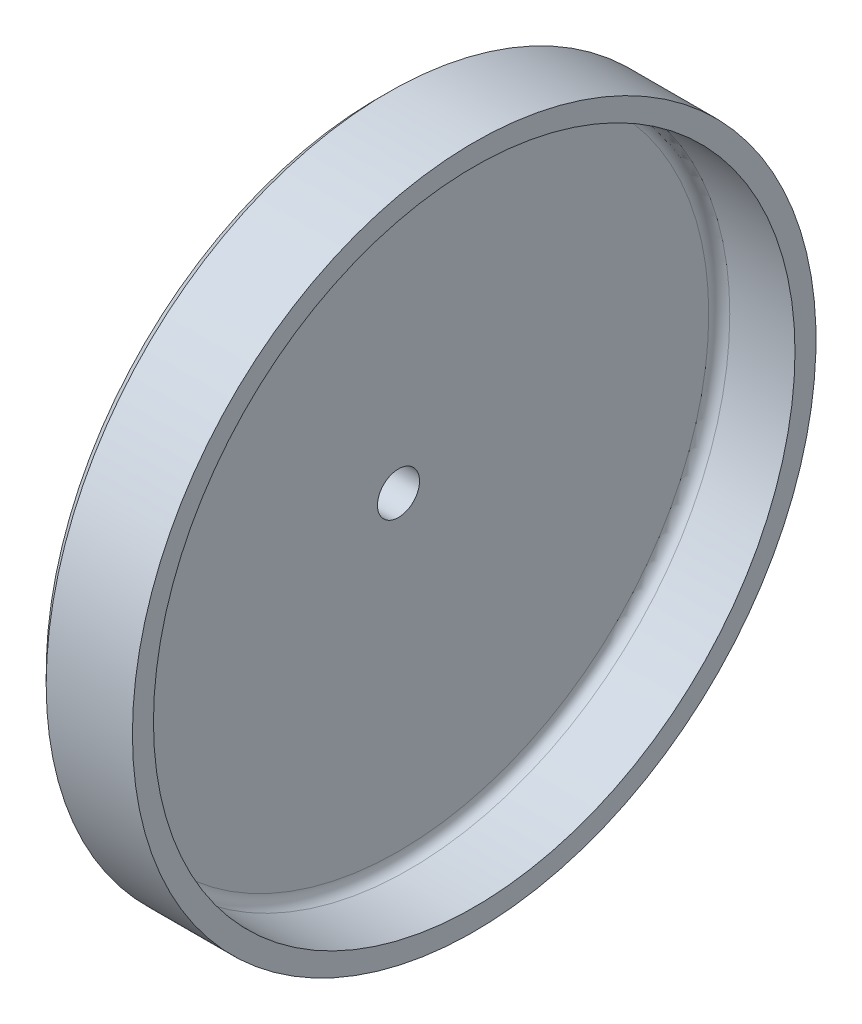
ISO-10303-21;
HEADER;
FILE_DESCRIPTION(('STEP AP214'),'2;1');
FILE_NAME('part.step','',(''),(''),'','','');
FILE_SCHEMA(('AUTOMOTIVE_DESIGN { 1 0 10303 214 1 1 1 1 }'));
ENDSEC;
DATA;
#1=APPLICATION_CONTEXT('core data for automotive mechanical design processes');
#2=APPLICATION_PROTOCOL_DEFINITION('international standard','automotive_design',2000,#1);
#3=PRODUCT_CONTEXT('',#1,'mechanical');
#4=PRODUCT('Part','Part','',(#3));
#5=PRODUCT_RELATED_PRODUCT_CATEGORY('part','',(#4));
#6=PRODUCT_DEFINITION_FORMATION('','',#4);
#7=PRODUCT_DEFINITION_CONTEXT('part definition',#1,'design');
#8=PRODUCT_DEFINITION('design','',#6,#7);
#9=PRODUCT_DEFINITION_SHAPE('','',#8);
#10=(LENGTH_UNIT() NAMED_UNIT(*) SI_UNIT(.MILLI.,.METRE.));
#11=(NAMED_UNIT(*) PLANE_ANGLE_UNIT() SI_UNIT($,.RADIAN.));
#12=(NAMED_UNIT(*) SI_UNIT($,.STERADIAN.) SOLID_ANGLE_UNIT());
#13=UNCERTAINTY_MEASURE_WITH_UNIT(LENGTH_MEASURE(1.E-05),#10,'distance_accuracy_value','');
#14=(GEOMETRIC_REPRESENTATION_CONTEXT(3) GLOBAL_UNCERTAINTY_ASSIGNED_CONTEXT((#13)) GLOBAL_UNIT_ASSIGNED_CONTEXT((#10,
#11,#12)) REPRESENTATION_CONTEXT('',''));
#15=CARTESIAN_POINT('',(0.,0.,0.));
#16=DIRECTION('',(0.,0.,1.));
#17=DIRECTION('',(1.,0.,0.));
#18=AXIS2_PLACEMENT_3D('',#15,#16,#17);
#19=CARTESIAN_POINT('',(-40.1860188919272,0.,0.));
#20=DIRECTION('',(-1.,0.,0.));
#21=DIRECTION('',(0.,0.,1.));
#22=AXIS2_PLACEMENT_3D('',#19,#20,#21);
#23=CYLINDRICAL_SURFACE('',#22,45.);
#24=CARTESIAN_POINT('',(7.,0.,0.));
#25=DIRECTION('',(-1.,0.,0.));
#26=DIRECTION('',(0.,0.,1.));
#27=AXIS2_PLACEMENT_3D('',#24,#25,#26);
#28=CIRCLE('',#27,45.);
#29=CARTESIAN_POINT('',(7.,0.,45.));
#30=VERTEX_POINT('',#29);
#31=EDGE_CURVE('E483',#30,#30,#28,.T.);
#32=ORIENTED_EDGE('',*,*,#31,.F.);
#33=EDGE_LOOP('',(#32));
#34=FACE_BOUND('',#33,.T.);
#35=CARTESIAN_POINT('',(0.,0.,0.));
#36=DIRECTION('',(-1.,0.,0.));
#37=DIRECTION('',(0.,0.,1.));
#38=AXIS2_PLACEMENT_3D('',#35,#36,#37);
#39=CIRCLE('',#38,45.);
#40=CARTESIAN_POINT('',(0.,0.,45.));
#41=VERTEX_POINT('',#40);
#42=EDGE_CURVE('E504',#41,#41,#39,.T.);
#43=ORIENTED_EDGE('',*,*,#42,.T.);
#44=EDGE_LOOP('',(#43));
#45=FACE_BOUND('',#44,.T.);
#46=ADVANCED_FACE('F450',(#34,#45),#23,.F.);
#47=CARTESIAN_POINT('',(0.,45.,0.));
#48=DIRECTION('',(1.,0.,0.));
#49=DIRECTION('',(0.,0.,-1.));
#50=AXIS2_PLACEMENT_3D('',#47,#48,#49);
#51=PLANE('',#50);
#52=CARTESIAN_POINT('',(0.,80.,0.));
#53=DIRECTION('',(-1.,0.,0.));
#54=DIRECTION('',(0.,0.,1.));
#55=AXIS2_PLACEMENT_3D('',#52,#53,#54);
#56=CIRCLE('',#55,5.);
#57=CARTESIAN_POINT('',(0.,80.,5.));
#58=VERTEX_POINT('',#57);
#59=EDGE_CURVE('E468',#58,#58,#56,.T.);
#60=ORIENTED_EDGE('',*,*,#59,.F.);
#61=EDGE_LOOP('',(#60));
#62=FACE_BOUND('',#61,.T.);
#63=ORIENTED_EDGE('',*,*,#42,.F.);
#64=EDGE_LOOP('',(#63));
#65=FACE_BOUND('',#64,.T.);
#66=CARTESIAN_POINT('',(0.,0.,0.));
#67=DIRECTION('',(-1.,0.,0.));
#68=DIRECTION('',(0.,0.,1.));
#69=AXIS2_PLACEMENT_3D('',#66,#67,#68);
#70=CIRCLE('',#69,92.5);
#71=CARTESIAN_POINT('',(0.,0.,92.5));
#72=VERTEX_POINT('',#71);
#73=EDGE_CURVE('E501',#72,#72,#70,.T.);
#74=ORIENTED_EDGE('',*,*,#73,.T.);
#75=EDGE_LOOP('',(#74));
#76=FACE_BOUND('',#75,.T.);
#77=ADVANCED_FACE('F532',(#62,#65,#76),#51,.F.);
#78=CARTESIAN_POINT('',(-40.1860188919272,0.,0.));
#79=DIRECTION('',(-1.,0.,0.));
#80=DIRECTION('',(0.,0.,1.));
#81=AXIS2_PLACEMENT_3D('',#78,#79,#80);
#82=CYLINDRICAL_SURFACE('',#81,92.5);
#83=ORIENTED_EDGE('',*,*,#73,.F.);
#84=EDGE_LOOP('',(#83));
#85=FACE_BOUND('',#84,.T.);
#86=CARTESIAN_POINT('',(20.,0.,0.));
#87=DIRECTION('',(-1.,0.,0.));
#88=DIRECTION('',(0.,0.,1.));
#89=AXIS2_PLACEMENT_3D('',#86,#87,#88);
#90=CIRCLE('',#89,92.5);
#91=CARTESIAN_POINT('',(20.,0.,92.5));
#92=VERTEX_POINT('',#91);
#93=EDGE_CURVE('E498',#92,#92,#90,.T.);
#94=ORIENTED_EDGE('',*,*,#93,.T.);
#95=EDGE_LOOP('',(#94));
#96=FACE_BOUND('',#95,.T.);
#97=ADVANCED_FACE('F537',(#85,#96),#82,.T.);
#98=CARTESIAN_POINT('',(20.,92.5,0.));
#99=DIRECTION('',(1.,0.,0.));
#100=DIRECTION('',(0.,0.,-1.));
#101=AXIS2_PLACEMENT_3D('',#98,#99,#100);
#102=PLANE('',#101);
#103=CARTESIAN_POINT('',(20.,0.,0.));
#104=DIRECTION('',(1.,0.,0.));
#105=DIRECTION('',(0.,0.,-1.));
#106=AXIS2_PLACEMENT_3D('',#103,#104,#105);
#107=CIRCLE('',#106,157.5);
#108=CARTESIAN_POINT('',(20.,0.,-157.5));
#109=VERTEX_POINT('',#108);
#110=EDGE_CURVE('E456',#109,#109,#107,.F.);
#111=ORIENTED_EDGE('',*,*,#110,.T.);
#112=EDGE_LOOP('',(#111));
#113=FACE_BOUND('',#112,.T.);
#114=ORIENTED_EDGE('',*,*,#93,.F.);
#115=EDGE_LOOP('',(#114));
#116=FACE_BOUND('',#115,.T.);
#117=ADVANCED_FACE('F511',(#113,#116),#102,.F.);
#118=CARTESIAN_POINT('',(-40.1860188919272,0.,0.));
#119=DIRECTION('',(-1.,0.,0.));
#120=DIRECTION('',(0.,0.,1.));
#121=AXIS2_PLACEMENT_3D('',#118,#119,#120);
#122=CYLINDRICAL_SURFACE('',#121,162.5);
#123=CARTESIAN_POINT('',(25.,0.,0.));
#124=DIRECTION('',(1.,0.,0.));
#125=DIRECTION('',(0.,0.,-1.));
#126=AXIS2_PLACEMENT_3D('',#123,#124,#125);
#127=CIRCLE('',#126,162.5);
#128=CARTESIAN_POINT('',(25.,0.,-162.5));
#129=VERTEX_POINT('',#128);
#130=EDGE_CURVE('E11',#129,#129,#127,.T.);
#131=ORIENTED_EDGE('',*,*,#130,.T.);
#132=EDGE_LOOP('',(#131));
#133=FACE_BOUND('',#132,.T.);
#134=CARTESIAN_POINT('',(66.,0.,0.));
#135=DIRECTION('',(-1.,0.,0.));
#136=DIRECTION('',(0.,0.,1.));
#137=AXIS2_PLACEMENT_3D('',#134,#135,#136);
#138=CIRCLE('',#137,162.5);
#139=CARTESIAN_POINT('',(66.,0.,162.5));
#140=VERTEX_POINT('',#139);
#141=EDGE_CURVE('E495',#140,#140,#138,.T.);
#142=ORIENTED_EDGE('',*,*,#141,.T.);
#143=EDGE_LOOP('',(#142));
#144=FACE_BOUND('',#143,.T.);
#145=ADVANCED_FACE('F550',(#133,#144),#122,.T.);
#146=CARTESIAN_POINT('',(66.,162.5,0.));
#147=DIRECTION('',(-1.,0.,0.));
#148=DIRECTION('',(0.,0.,1.));
#149=AXIS2_PLACEMENT_3D('',#146,#147,#148);
#150=PLANE('',#149);
#151=ORIENTED_EDGE('',*,*,#141,.F.);
#152=EDGE_LOOP('',(#151));
#153=FACE_BOUND('',#152,.T.);
#154=CARTESIAN_POINT('',(66.,0.,0.));
#155=DIRECTION('',(-1.,0.,0.));
#156=DIRECTION('',(0.,0.,1.));
#157=AXIS2_PLACEMENT_3D('',#154,#155,#156);
#158=CIRCLE('',#157,152.5);
#159=CARTESIAN_POINT('',(66.,0.,152.5));
#160=VERTEX_POINT('',#159);
#161=EDGE_CURVE('E492',#160,#160,#158,.T.);
#162=ORIENTED_EDGE('',*,*,#161,.T.);
#163=EDGE_LOOP('',(#162));
#164=FACE_BOUND('',#163,.T.);
#165=ADVANCED_FACE('F554',(#153,#164),#150,.F.);
#166=CARTESIAN_POINT('',(-40.1860188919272,0.,0.));
#167=DIRECTION('',(-1.,0.,0.));
#168=DIRECTION('',(0.,0.,1.));
#169=AXIS2_PLACEMENT_3D('',#166,#167,#168);
#170=CYLINDRICAL_SURFACE('',#169,152.5);
#171=ORIENTED_EDGE('',*,*,#161,.F.);
#172=EDGE_LOOP('',(#171));
#173=FACE_BOUND('',#172,.T.);
#174=CARTESIAN_POINT('',(35.,0.,0.));
#175=DIRECTION('',(-1.,0.,0.));
#176=DIRECTION('',(0.,0.,1.));
#177=AXIS2_PLACEMENT_3D('',#174,#175,#176);
#178=CIRCLE('',#177,152.5);
#179=CARTESIAN_POINT('',(35.,0.,152.5));
#180=VERTEX_POINT('',#179);
#181=EDGE_CURVE('E489',#180,#180,#178,.T.);
#182=ORIENTED_EDGE('',*,*,#181,.T.);
#183=EDGE_LOOP('',(#182));
#184=FACE_BOUND('',#183,.T.);
#185=ADVANCED_FACE('F560',(#173,#184),#170,.F.);
#186=CARTESIAN_POINT('',(35.,0.,0.));
#187=DIRECTION('',(-1.,0.,0.));
#188=DIRECTION('',(0.,0.,1.));
#189=AXIS2_PLACEMENT_3D('',#186,#187,#188);
#190=TOROIDAL_SURFACE('',#189,147.5,5.);
#191=ORIENTED_EDGE('',*,*,#181,.F.);
#192=EDGE_LOOP('',(#191));
#193=FACE_BOUND('',#192,.T.);
#194=CARTESIAN_POINT('',(30.,0.,0.));
#195=DIRECTION('',(-1.,0.,0.));
#196=DIRECTION('',(0.,0.,1.));
#197=AXIS2_PLACEMENT_3D('',#194,#195,#196);
#198=CIRCLE('',#197,147.5);
#199=CARTESIAN_POINT('',(30.,0.,147.5));
#200=VERTEX_POINT('',#199);
#201=EDGE_CURVE('E486',#200,#200,#198,.T.);
#202=ORIENTED_EDGE('',*,*,#201,.T.);
#203=EDGE_LOOP('',(#202));
#204=FACE_BOUND('',#203,.T.);
#205=ADVANCED_FACE('F564',(#193,#204),#190,.F.);
#206=CARTESIAN_POINT('',(30.,147.5,0.));
#207=DIRECTION('',(-1.,0.,0.));
#208=DIRECTION('',(0.,0.,1.));
#209=AXIS2_PLACEMENT_3D('',#206,#207,#208);
#210=PLANE('',#209);
#211=CARTESIAN_POINT('',(30.,0.,0.));
#212=DIRECTION('',(1.,0.,0.));
#213=DIRECTION('',(0.,0.,-1.));
#214=AXIS2_PLACEMENT_3D('',#211,#212,#213);
#215=CIRCLE('',#214,10.);
#216=CARTESIAN_POINT('',(30.,0.,-10.));
#217=VERTEX_POINT('',#216);
#218=EDGE_CURVE('E479',#217,#217,#215,.T.);
#219=ORIENTED_EDGE('',*,*,#218,.F.);
#220=EDGE_LOOP('',(#219));
#221=FACE_BOUND('',#220,.T.);
#222=ORIENTED_EDGE('',*,*,#201,.F.);
#223=EDGE_LOOP('',(#222));
#224=FACE_BOUND('',#223,.T.);
#225=ADVANCED_FACE('F568',(#221,#224),#210,.F.);
#226=CARTESIAN_POINT('',(7.,0.,0.));
#227=DIRECTION('',(1.,0.,0.));
#228=DIRECTION('',(0.,0.,-1.));
#229=AXIS2_PLACEMENT_3D('',#226,#227,#228);
#230=PLANE('',#229);
#231=CARTESIAN_POINT('',(7.,0.,0.));
#232=DIRECTION('',(1.,0.,0.));
#233=DIRECTION('',(0.,0.,-1.));
#234=AXIS2_PLACEMENT_3D('',#231,#232,#233);
#235=CIRCLE('',#234,6.25);
#236=CARTESIAN_POINT('',(7.,0.,-6.25));
#237=VERTEX_POINT('',#236);
#238=EDGE_CURVE('E482',#237,#237,#235,.T.);
#239=ORIENTED_EDGE('',*,*,#238,.T.);
#240=EDGE_LOOP('',(#239));
#241=FACE_BOUND('',#240,.T.);
#242=ORIENTED_EDGE('',*,*,#31,.T.);
#243=EDGE_LOOP('',(#242));
#244=FACE_BOUND('',#243,.T.);
#245=ADVANCED_FACE('F572',(#241,#244),#230,.F.);
#246=CARTESIAN_POINT('',(30.,0.,0.));
#247=DIRECTION('',(1.,0.,0.));
#248=DIRECTION('',(0.,0.,-1.));
#249=AXIS2_PLACEMENT_3D('',#246,#247,#248);
#250=CYLINDRICAL_SURFACE('',#249,6.25);
#251=CARTESIAN_POINT('',(15.,0.,0.));
#252=DIRECTION('',(1.,0.,0.));
#253=DIRECTION('',(0.,0.,-1.));
#254=AXIS2_PLACEMENT_3D('',#251,#252,#253);
#255=CIRCLE('',#254,6.25);
#256=CARTESIAN_POINT('',(15.,0.,-6.25));
#257=VERTEX_POINT('',#256);
#258=EDGE_CURVE('E471',#257,#257,#255,.T.);
#259=ORIENTED_EDGE('',*,*,#258,.T.);
#260=EDGE_LOOP('',(#259));
#261=FACE_BOUND('',#260,.T.);
#262=ORIENTED_EDGE('',*,*,#238,.F.);
#263=EDGE_LOOP('',(#262));
#264=FACE_BOUND('',#263,.T.);
#265=ADVANCED_FACE('F576',(#261,#264),#250,.F.);
#266=CARTESIAN_POINT('',(30.,0.,0.));
#267=DIRECTION('',(1.,0.,0.));
#268=DIRECTION('',(0.,0.,-1.));
#269=AXIS2_PLACEMENT_3D('',#266,#267,#268);
#270=CYLINDRICAL_SURFACE('',#269,10.);
#271=CARTESIAN_POINT('',(15.,0.,0.));
#272=DIRECTION('',(1.,0.,0.));
#273=DIRECTION('',(0.,0.,-1.));
#274=AXIS2_PLACEMENT_3D('',#271,#272,#273);
#275=CIRCLE('',#274,10.);
#276=CARTESIAN_POINT('',(15.,0.,-10.));
#277=VERTEX_POINT('',#276);
#278=EDGE_CURVE('E476',#277,#277,#275,.T.);
#279=ORIENTED_EDGE('',*,*,#278,.F.);
#280=EDGE_LOOP('',(#279));
#281=FACE_BOUND('',#280,.T.);
#282=ORIENTED_EDGE('',*,*,#218,.T.);
#283=EDGE_LOOP('',(#282));
#284=FACE_BOUND('',#283,.T.);
#285=ADVANCED_FACE('F526',(#281,#284),#270,.F.);
#286=CARTESIAN_POINT('',(15.,6.25,0.));
#287=DIRECTION('',(-1.,0.,0.));
#288=DIRECTION('',(0.,0.,1.));
#289=AXIS2_PLACEMENT_3D('',#286,#287,#288);
#290=PLANE('',#289);
#291=ORIENTED_EDGE('',*,*,#258,.F.);
#292=EDGE_LOOP('',(#291));
#293=FACE_BOUND('',#292,.T.);
#294=ORIENTED_EDGE('',*,*,#278,.T.);
#295=EDGE_LOOP('',(#294));
#296=FACE_BOUND('',#295,.T.);
#297=ADVANCED_FACE('F516',(#293,#296),#290,.F.);
#298=CARTESIAN_POINT('',(20.,0.,0.));
#299=DIRECTION('',(1.,0.,0.));
#300=DIRECTION('',(0.,0.,-1.));
#301=AXIS2_PLACEMENT_3D('',#298,#299,#300);
#302=CONICAL_SURFACE('',#301,157.5,0.785398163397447);
#303=ORIENTED_EDGE('',*,*,#130,.F.);
#304=EDGE_LOOP('',(#303));
#305=FACE_BOUND('',#304,.T.);
#306=ORIENTED_EDGE('',*,*,#110,.F.);
#307=EDGE_LOOP('',(#306));
#308=FACE_BOUND('',#307,.T.);
#309=ADVANCED_FACE('F514',(#305,#308),#302,.T.);
#310=CARTESIAN_POINT('',(0.,80.,0.));
#311=DIRECTION('',(-1.,0.,0.));
#312=DIRECTION('',(0.,0.,1.));
#313=AXIS2_PLACEMENT_3D('',#310,#311,#312);
#314=CYLINDRICAL_SURFACE('',#313,5.);
#315=CARTESIAN_POINT('',(15.,80.,0.));
#316=DIRECTION('',(-1.,0.,0.));
#317=DIRECTION('',(0.,0.,1.));
#318=AXIS2_PLACEMENT_3D('',#315,#316,#317);
#319=CIRCLE('',#318,4.99999999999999);
#320=CARTESIAN_POINT('',(15.,80.,4.99999999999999));
#321=VERTEX_POINT('',#320);
#322=EDGE_CURVE('E466',#321,#321,#319,.T.);
#323=ORIENTED_EDGE('',*,*,#322,.F.);
#324=EDGE_LOOP('',(#323));
#325=FACE_BOUND('',#324,.T.);
#326=ORIENTED_EDGE('',*,*,#59,.T.);
#327=EDGE_LOOP('',(#326));
#328=FACE_BOUND('',#327,.T.);
#329=ADVANCED_FACE('F462',(#325,#328),#314,.F.);
#330=CARTESIAN_POINT('',(15.,80.,0.));
#331=DIRECTION('',(-1.,0.,0.));
#332=DIRECTION('',(0.,0.,1.));
#333=AXIS2_PLACEMENT_3D('',#330,#331,#332);
#334=CONICAL_SURFACE('',#333,4.99999999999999,1.02974425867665);
#335=CARTESIAN_POINT('',(18.0043030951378,80.,0.));
#336=VERTEX_POINT('',#335);
#337=VERTEX_LOOP('',#336);
#338=FACE_BOUND('',#337,.T.);
#339=ORIENTED_EDGE('',*,*,#322,.T.);
#340=EDGE_LOOP('',(#339));
#341=FACE_BOUND('',#340,.T.);
#342=ADVANCED_FACE('F459',(#338,#341),#334,.F.);
#343=CLOSED_SHELL('',(#46,#77,#97,#117,#145,#165,#185,#205,#225,#245,#265,#285,#297,#309,#329,#342));
#344=MANIFOLD_SOLID_BREP('B2',#343);
#345=ADVANCED_BREP_SHAPE_REPRESENTATION('',(#18,#344),#14);
#346=SHAPE_DEFINITION_REPRESENTATION(#9,#345);
ENDSEC;
END-ISO-10303-21;
